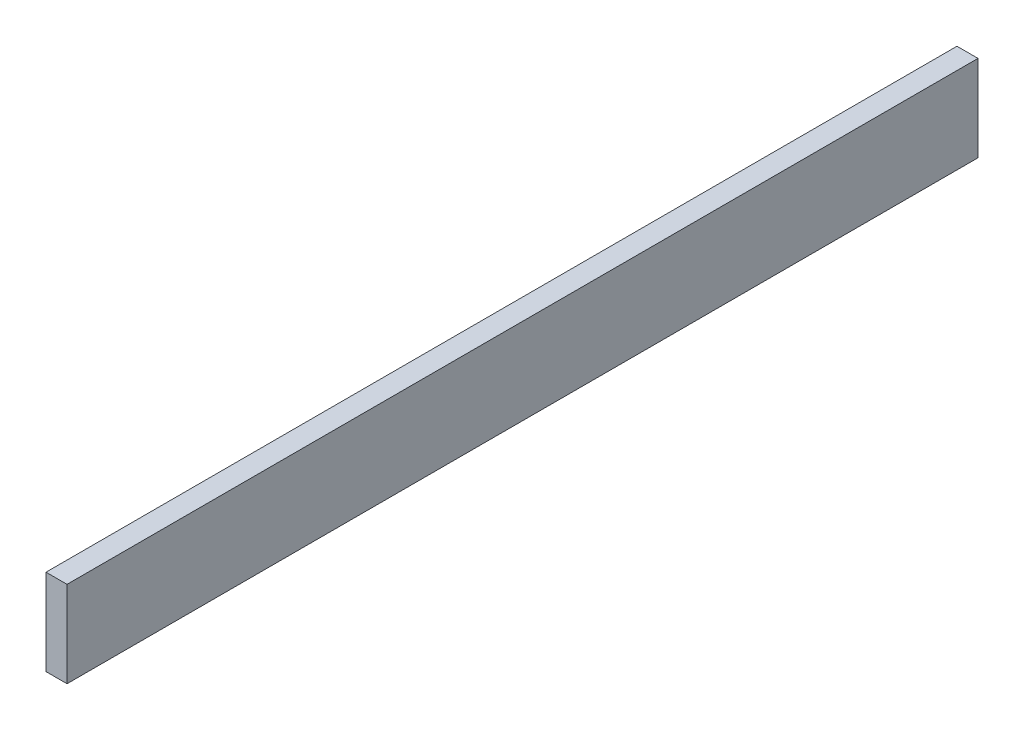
ISO-10303-21;
HEADER;
FILE_DESCRIPTION(('STEP AP214'),'2;1');
FILE_NAME('part.step','',(''),(''),'','','');
FILE_SCHEMA(('AUTOMOTIVE_DESIGN { 1 0 10303 214 1 1 1 1 }'));
ENDSEC;
DATA;
#1=APPLICATION_CONTEXT('core data for automotive mechanical design processes');
#2=APPLICATION_PROTOCOL_DEFINITION('international standard','automotive_design',2000,#1);
#3=PRODUCT_CONTEXT('',#1,'mechanical');
#4=PRODUCT('Part','Part','',(#3));
#5=PRODUCT_RELATED_PRODUCT_CATEGORY('part','',(#4));
#6=PRODUCT_DEFINITION_FORMATION('','',#4);
#7=PRODUCT_DEFINITION_CONTEXT('part definition',#1,'design');
#8=PRODUCT_DEFINITION('design','',#6,#7);
#9=PRODUCT_DEFINITION_SHAPE('','',#8);
#10=(LENGTH_UNIT() NAMED_UNIT(*) SI_UNIT(.MILLI.,.METRE.));
#11=(NAMED_UNIT(*) PLANE_ANGLE_UNIT() SI_UNIT($,.RADIAN.));
#12=(NAMED_UNIT(*) SI_UNIT($,.STERADIAN.) SOLID_ANGLE_UNIT());
#13=UNCERTAINTY_MEASURE_WITH_UNIT(LENGTH_MEASURE(1.E-05),#10,'distance_accuracy_value','');
#14=(GEOMETRIC_REPRESENTATION_CONTEXT(3) GLOBAL_UNCERTAINTY_ASSIGNED_CONTEXT((#13)) GLOBAL_UNIT_ASSIGNED_CONTEXT((#10,
#11,#12)) REPRESENTATION_CONTEXT('',''));
#15=CARTESIAN_POINT('',(0.,0.,0.));
#16=DIRECTION('',(0.,0.,1.));
#17=DIRECTION('',(1.,0.,0.));
#18=AXIS2_PLACEMENT_3D('',#15,#16,#17);
#19=CARTESIAN_POINT('',(-11.467669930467,-2.00110760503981,51.6244563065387));
#20=DIRECTION('',(0.,0.,1.));
#21=DIRECTION('',(0.,-1.,0.));
#22=AXIS2_PLACEMENT_3D('',#19,#20,#21);
#23=PLANE('',#22);
#24=DIRECTION('',(1.,0.,0.));
#25=VECTOR('',#24,1.);
#26=CARTESIAN_POINT('',(-12.261419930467,1.24889239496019,51.6244563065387));
#27=LINE('',#26,#25);
#28=CARTESIAN_POINT('',(-12.261419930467,1.24889239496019,51.6244563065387));
#29=VERTEX_POINT('',#28);
#30=CARTESIAN_POINT('',(-10.673919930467,1.24889239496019,51.6244563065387));
#31=VERTEX_POINT('',#30);
#32=EDGE_CURVE('E20',#29,#31,#27,.T.);
#33=ORIENTED_EDGE('',*,*,#32,.T.);
#34=DIRECTION('',(0.,-1.,0.));
#35=VECTOR('',#34,1.);
#36=CARTESIAN_POINT('',(-10.673919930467,1.24889239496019,51.6244563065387));
#37=LINE('',#36,#35);
#38=CARTESIAN_POINT('',(-10.673919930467,-5.25110760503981,51.6244563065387));
#39=VERTEX_POINT('',#38);
#40=EDGE_CURVE('E72',#31,#39,#37,.T.);
#41=ORIENTED_EDGE('',*,*,#40,.T.);
#42=DIRECTION('',(-1.,0.,0.));
#43=VECTOR('',#42,1.);
#44=CARTESIAN_POINT('',(-10.673919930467,-5.25110760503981,51.6244563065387));
#45=LINE('',#44,#43);
#46=CARTESIAN_POINT('',(-12.261419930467,-5.25110760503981,51.6244563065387));
#47=VERTEX_POINT('',#46);
#48=EDGE_CURVE('E102',#39,#47,#45,.T.);
#49=ORIENTED_EDGE('',*,*,#48,.T.);
#50=DIRECTION('',(0.,1.,0.));
#51=VECTOR('',#50,1.);
#52=CARTESIAN_POINT('',(-12.261419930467,-5.25110760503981,51.6244563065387));
#53=LINE('',#52,#51);
#54=EDGE_CURVE('E73',#47,#29,#53,.T.);
#55=ORIENTED_EDGE('',*,*,#54,.T.);
#56=EDGE_LOOP('',(#33,#41,#49,#55));
#57=FACE_BOUND('',#56,.T.);
#58=ADVANCED_FACE('F17',(#57),#23,.F.);
#59=CARTESIAN_POINT('',(-11.467669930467,-2.00110760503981,120.384456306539));
#60=DIRECTION('',(0.,0.,1.));
#61=DIRECTION('',(0.,-1.,0.));
#62=AXIS2_PLACEMENT_3D('',#59,#60,#61);
#63=PLANE('',#62);
#64=DIRECTION('',(-1.,0.,0.));
#65=VECTOR('',#64,1.);
#66=CARTESIAN_POINT('',(-12.261419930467,1.24889239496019,120.384456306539));
#67=LINE('',#66,#65);
#68=CARTESIAN_POINT('',(-10.673919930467,1.24889239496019,120.384456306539));
#69=VERTEX_POINT('',#68);
#70=CARTESIAN_POINT('',(-12.261419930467,1.24889239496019,120.384456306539));
#71=VERTEX_POINT('',#70);
#72=EDGE_CURVE('E11',#69,#71,#67,.T.);
#73=ORIENTED_EDGE('',*,*,#72,.T.);
#74=DIRECTION('',(0.,-1.,0.));
#75=VECTOR('',#74,1.);
#76=CARTESIAN_POINT('',(-12.261419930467,-5.2511076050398,120.384456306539));
#77=LINE('',#76,#75);
#78=CARTESIAN_POINT('',(-12.261419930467,-5.2511076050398,120.384456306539));
#79=VERTEX_POINT('',#78);
#80=EDGE_CURVE('E109',#71,#79,#77,.T.);
#81=ORIENTED_EDGE('',*,*,#80,.T.);
#82=DIRECTION('',(1.,0.,0.));
#83=VECTOR('',#82,1.);
#84=CARTESIAN_POINT('',(-10.673919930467,-5.2511076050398,120.384456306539));
#85=LINE('',#84,#83);
#86=CARTESIAN_POINT('',(-10.673919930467,-5.2511076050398,120.384456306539));
#87=VERTEX_POINT('',#86);
#88=EDGE_CURVE('E97',#79,#87,#85,.T.);
#89=ORIENTED_EDGE('',*,*,#88,.T.);
#90=DIRECTION('',(0.,1.,0.));
#91=VECTOR('',#90,1.);
#92=CARTESIAN_POINT('',(-10.673919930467,1.24889239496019,120.384456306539));
#93=LINE('',#92,#91);
#94=EDGE_CURVE('E82',#87,#69,#93,.T.);
#95=ORIENTED_EDGE('',*,*,#94,.T.);
#96=EDGE_LOOP('',(#73,#81,#89,#95));
#97=FACE_BOUND('',#96,.T.);
#98=ADVANCED_FACE('F118',(#97),#63,.T.);
#99=CARTESIAN_POINT('',(-10.673919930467,1.24889239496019,51.6244563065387));
#100=DIRECTION('',(0.,1.,0.));
#101=DIRECTION('',(0.,0.,-1.));
#102=AXIS2_PLACEMENT_3D('',#99,#100,#101);
#103=PLANE('',#102);
#104=ORIENTED_EDGE('',*,*,#32,.F.);
#105=DIRECTION('',(0.,0.,1.));
#106=VECTOR('',#105,1.);
#107=CARTESIAN_POINT('',(-12.261419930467,1.24889239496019,51.6244563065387));
#108=LINE('',#107,#106);
#109=EDGE_CURVE('E75',#29,#71,#108,.T.);
#110=ORIENTED_EDGE('',*,*,#109,.T.);
#111=ORIENTED_EDGE('',*,*,#72,.F.);
#112=DIRECTION('',(0.,0.,1.));
#113=VECTOR('',#112,1.);
#114=CARTESIAN_POINT('',(-10.673919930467,1.24889239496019,51.6244563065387));
#115=LINE('',#114,#113);
#116=EDGE_CURVE('E77',#31,#69,#115,.T.);
#117=ORIENTED_EDGE('',*,*,#116,.F.);
#118=EDGE_LOOP('',(#104,#110,#111,#117));
#119=FACE_BOUND('',#118,.T.);
#120=ADVANCED_FACE('F78',(#119),#103,.T.);
#121=CARTESIAN_POINT('',(-12.261419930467,1.24889239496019,51.6244563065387));
#122=DIRECTION('',(-1.,0.,0.));
#123=DIRECTION('',(0.,1.,0.));
#124=AXIS2_PLACEMENT_3D('',#121,#122,#123);
#125=PLANE('',#124);
#126=ORIENTED_EDGE('',*,*,#54,.F.);
#127=DIRECTION('',(0.,0.,1.));
#128=VECTOR('',#127,1.);
#129=CARTESIAN_POINT('',(-12.261419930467,-5.25110760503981,51.6244563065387));
#130=LINE('',#129,#128);
#131=EDGE_CURVE('E93',#47,#79,#130,.T.);
#132=ORIENTED_EDGE('',*,*,#131,.T.);
#133=ORIENTED_EDGE('',*,*,#80,.F.);
#134=ORIENTED_EDGE('',*,*,#109,.F.);
#135=EDGE_LOOP('',(#126,#132,#133,#134));
#136=FACE_BOUND('',#135,.T.);
#137=ADVANCED_FACE('F115',(#136),#125,.T.);
#138=CARTESIAN_POINT('',(-12.261419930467,-5.25110760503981,51.6244563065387));
#139=DIRECTION('',(0.,-1.,0.));
#140=DIRECTION('',(-1.,0.,0.));
#141=AXIS2_PLACEMENT_3D('',#138,#139,#140);
#142=PLANE('',#141);
#143=ORIENTED_EDGE('',*,*,#48,.F.);
#144=DIRECTION('',(0.,0.,1.));
#145=VECTOR('',#144,1.);
#146=CARTESIAN_POINT('',(-10.673919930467,-5.25110760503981,51.6244563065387));
#147=LINE('',#146,#145);
#148=EDGE_CURVE('E87',#39,#87,#147,.T.);
#149=ORIENTED_EDGE('',*,*,#148,.T.);
#150=ORIENTED_EDGE('',*,*,#88,.F.);
#151=ORIENTED_EDGE('',*,*,#131,.F.);
#152=EDGE_LOOP('',(#143,#149,#150,#151));
#153=FACE_BOUND('',#152,.T.);
#154=ADVANCED_FACE('F120',(#153),#142,.T.);
#155=CARTESIAN_POINT('',(-10.673919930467,-5.25110760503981,51.6244563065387));
#156=DIRECTION('',(1.,0.,0.));
#157=DIRECTION('',(0.,-1.,0.));
#158=AXIS2_PLACEMENT_3D('',#155,#156,#157);
#159=PLANE('',#158);
#160=ORIENTED_EDGE('',*,*,#40,.F.);
#161=ORIENTED_EDGE('',*,*,#116,.T.);
#162=ORIENTED_EDGE('',*,*,#94,.F.);
#163=ORIENTED_EDGE('',*,*,#148,.F.);
#164=EDGE_LOOP('',(#160,#161,#162,#163));
#165=FACE_BOUND('',#164,.T.);
#166=ADVANCED_FACE('F85',(#165),#159,.T.);
#167=CLOSED_SHELL('',(#58,#98,#120,#137,#154,#166));
#168=MANIFOLD_SOLID_BREP('B1',#167);
#169=ADVANCED_BREP_SHAPE_REPRESENTATION('',(#18,#168),#14);
#170=SHAPE_DEFINITION_REPRESENTATION(#9,#169);
ENDSEC;
END-ISO-10303-21;
